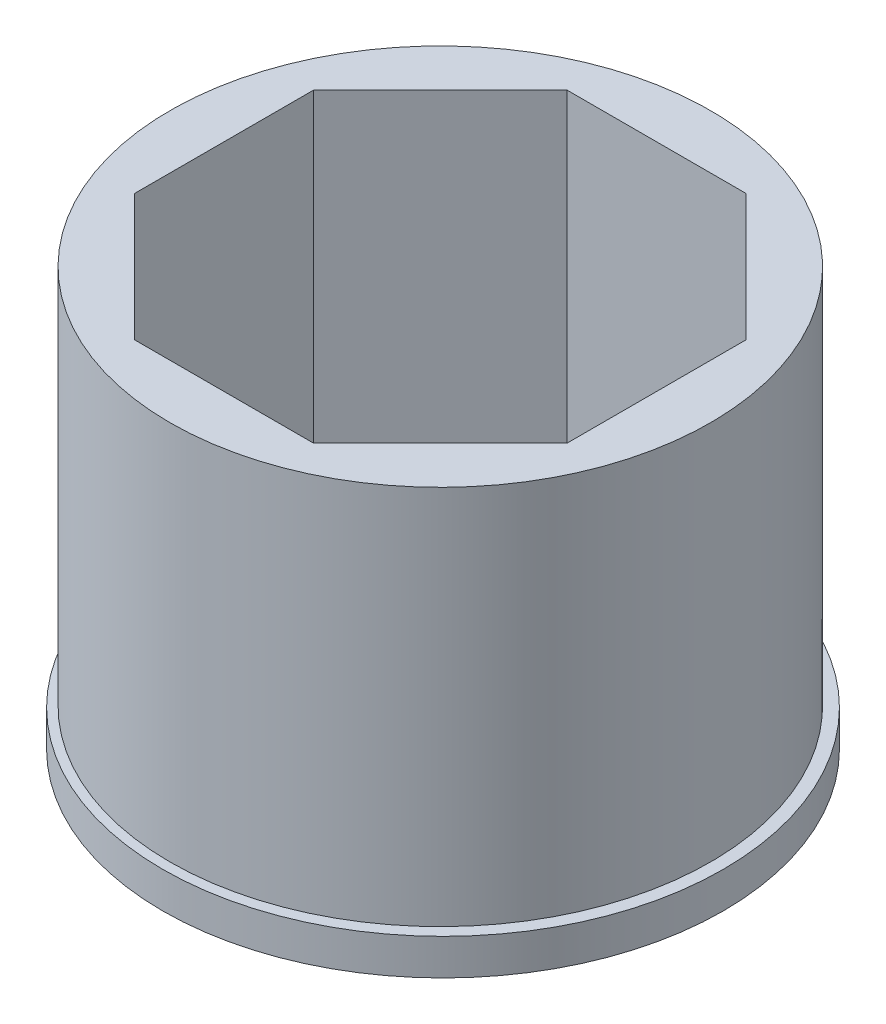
ISO-10303-21;
HEADER;
FILE_DESCRIPTION(('STEP AP214'),'2;1');
FILE_NAME('part.step','',(''),(''),'','','');
FILE_SCHEMA(('AUTOMOTIVE_DESIGN { 1 0 10303 214 1 1 1 1 }'));
ENDSEC;
DATA;
#1=APPLICATION_CONTEXT('core data for automotive mechanical design processes');
#2=APPLICATION_PROTOCOL_DEFINITION('international standard','automotive_design',2000,#1);
#3=PRODUCT_CONTEXT('',#1,'mechanical');
#4=PRODUCT('Part','Part','',(#3));
#5=PRODUCT_RELATED_PRODUCT_CATEGORY('part','',(#4));
#6=PRODUCT_DEFINITION_FORMATION('','',#4);
#7=PRODUCT_DEFINITION_CONTEXT('part definition',#1,'design');
#8=PRODUCT_DEFINITION('design','',#6,#7);
#9=PRODUCT_DEFINITION_SHAPE('','',#8);
#10=(LENGTH_UNIT() NAMED_UNIT(*) SI_UNIT(.MILLI.,.METRE.));
#11=(NAMED_UNIT(*) PLANE_ANGLE_UNIT() SI_UNIT($,.RADIAN.));
#12=(NAMED_UNIT(*) SI_UNIT($,.STERADIAN.) SOLID_ANGLE_UNIT());
#13=UNCERTAINTY_MEASURE_WITH_UNIT(LENGTH_MEASURE(1.E-05),#10,'distance_accuracy_value','');
#14=(GEOMETRIC_REPRESENTATION_CONTEXT(3) GLOBAL_UNCERTAINTY_ASSIGNED_CONTEXT((#13)) GLOBAL_UNIT_ASSIGNED_CONTEXT((#10,
#11,#12)) REPRESENTATION_CONTEXT('',''));
#15=CARTESIAN_POINT('',(0.,0.,0.));
#16=DIRECTION('',(0.,0.,1.));
#17=DIRECTION('',(1.,0.,0.));
#18=AXIS2_PLACEMENT_3D('',#15,#16,#17);
#19=CARTESIAN_POINT('',(0.,9.5,0.));
#20=DIRECTION('',(0.,1.,0.));
#21=DIRECTION('',(0.,0.,1.));
#22=AXIS2_PLACEMENT_3D('',#19,#20,#21);
#23=PLANE('',#22);
#24=CARTESIAN_POINT('',(0.,9.5,0.));
#25=DIRECTION('',(0.,1.,0.));
#26=DIRECTION('',(0.,0.,1.));
#27=AXIS2_PLACEMENT_3D('',#24,#25,#26);
#28=CIRCLE('',#27,6.75);
#29=CARTESIAN_POINT('',(0.,9.5,6.75));
#30=VERTEX_POINT('',#29);
#31=EDGE_CURVE('E144',#30,#30,#28,.T.);
#32=ORIENTED_EDGE('',*,*,#31,.T.);
#33=EDGE_LOOP('',(#32));
#34=FACE_BOUND('',#33,.T.);
#35=DIRECTION('',(-0.707106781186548,0.,0.707106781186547));
#36=VECTOR('',#35,1.);
#37=CARTESIAN_POINT('',(3.81837661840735,9.5,3.81837661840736));
#38=LINE('',#37,#36);
#39=CARTESIAN_POINT('',(5.4,9.5,2.23675323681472));
#40=VERTEX_POINT('',#39);
#41=CARTESIAN_POINT('',(2.23675323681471,9.5,5.4));
#42=VERTEX_POINT('',#41);
#43=EDGE_CURVE('E99',#40,#42,#38,.T.);
#44=ORIENTED_EDGE('',*,*,#43,.T.);
#45=DIRECTION('',(-1.,0.,0.));
#46=VECTOR('',#45,1.);
#47=CARTESIAN_POINT('',(0.,9.5,5.4));
#48=LINE('',#47,#46);
#49=CARTESIAN_POINT('',(-2.23675323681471,9.5,5.4));
#50=VERTEX_POINT('',#49);
#51=EDGE_CURVE('E133',#42,#50,#48,.T.);
#52=ORIENTED_EDGE('',*,*,#51,.T.);
#53=DIRECTION('',(-0.707106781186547,0.,-0.707106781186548));
#54=VECTOR('',#53,1.);
#55=CARTESIAN_POINT('',(-3.81837661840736,9.5,3.81837661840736));
#56=LINE('',#55,#54);
#57=CARTESIAN_POINT('',(-5.4,9.5,2.23675323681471));
#58=VERTEX_POINT('',#57);
#59=EDGE_CURVE('E135',#50,#58,#56,.T.);
#60=ORIENTED_EDGE('',*,*,#59,.T.);
#61=DIRECTION('',(0.,0.,-1.));
#62=VECTOR('',#61,1.);
#63=CARTESIAN_POINT('',(-5.4,9.5,0.));
#64=LINE('',#63,#62);
#65=CARTESIAN_POINT('',(-5.4,9.5,-2.23675323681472));
#66=VERTEX_POINT('',#65);
#67=EDGE_CURVE('E126',#58,#66,#64,.T.);
#68=ORIENTED_EDGE('',*,*,#67,.T.);
#69=DIRECTION('',(0.707106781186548,0.,-0.707106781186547));
#70=VECTOR('',#69,1.);
#71=CARTESIAN_POINT('',(-3.81837661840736,9.5,-3.81837661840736));
#72=LINE('',#71,#70);
#73=CARTESIAN_POINT('',(-2.23675323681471,9.5,-5.4));
#74=VERTEX_POINT('',#73);
#75=EDGE_CURVE('E127',#66,#74,#72,.T.);
#76=ORIENTED_EDGE('',*,*,#75,.T.);
#77=DIRECTION('',(1.,0.,0.));
#78=VECTOR('',#77,1.);
#79=CARTESIAN_POINT('',(0.,9.5,-5.4));
#80=LINE('',#79,#78);
#81=CARTESIAN_POINT('',(2.23675323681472,9.5,-5.4));
#82=VERTEX_POINT('',#81);
#83=EDGE_CURVE('E122',#74,#82,#80,.T.);
#84=ORIENTED_EDGE('',*,*,#83,.T.);
#85=DIRECTION('',(0.707106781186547,0.,0.707106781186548));
#86=VECTOR('',#85,1.);
#87=CARTESIAN_POINT('',(3.81837661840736,9.5,-3.81837661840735));
#88=LINE('',#87,#86);
#89=CARTESIAN_POINT('',(5.4,9.5,-2.23675323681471));
#90=VERTEX_POINT('',#89);
#91=EDGE_CURVE('E118',#82,#90,#88,.T.);
#92=ORIENTED_EDGE('',*,*,#91,.T.);
#93=DIRECTION('',(0.,0.,1.));
#94=VECTOR('',#93,1.);
#95=CARTESIAN_POINT('',(5.4,9.5,0.));
#96=LINE('',#95,#94);
#97=EDGE_CURVE('E102',#90,#40,#96,.T.);
#98=ORIENTED_EDGE('',*,*,#97,.T.);
#99=EDGE_LOOP('',(#44,#52,#60,#68,#76,#84,#92,#98));
#100=FACE_BOUND('',#99,.T.);
#101=ADVANCED_FACE('F39',(#34,#100),#23,.T.);
#102=CARTESIAN_POINT('',(0.0674329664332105,-0.9,0.));
#103=DIRECTION('',(0.,1.,0.));
#104=DIRECTION('',(0.,0.,1.));
#105=AXIS2_PLACEMENT_3D('',#102,#103,#104);
#106=PLANE('',#105);
#107=CARTESIAN_POINT('',(0.0674329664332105,-0.9,0.));
#108=DIRECTION('',(0.,1.,0.));
#109=DIRECTION('',(0.,0.,1.));
#110=AXIS2_PLACEMENT_3D('',#107,#108,#109);
#111=CIRCLE('',#110,7.);
#112=CARTESIAN_POINT('',(0.0674329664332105,-0.9,7.));
#113=VERTEX_POINT('',#112);
#114=EDGE_CURVE('E139',#113,#113,#111,.T.);
#115=ORIENTED_EDGE('',*,*,#114,.F.);
#116=EDGE_LOOP('',(#115));
#117=FACE_BOUND('',#116,.T.);
#118=DIRECTION('',(-1.,0.,0.));
#119=VECTOR('',#118,1.);
#120=CARTESIAN_POINT('',(0.0674329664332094,-0.9,5.4));
#121=LINE('',#120,#119);
#122=CARTESIAN_POINT('',(2.23675323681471,-0.9,5.4));
#123=VERTEX_POINT('',#122);
#124=CARTESIAN_POINT('',(-2.23675323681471,-0.9,5.4));
#125=VERTEX_POINT('',#124);
#126=EDGE_CURVE('E11',#123,#125,#121,.T.);
#127=ORIENTED_EDGE('',*,*,#126,.F.);
#128=DIRECTION('',(-0.707106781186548,0.,0.707106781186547));
#129=VECTOR('',#128,1.);
#130=CARTESIAN_POINT('',(3.85209310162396,-0.9,3.78466013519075));
#131=LINE('',#130,#129);
#132=CARTESIAN_POINT('',(5.4,-0.9,2.23675323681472));
#133=VERTEX_POINT('',#132);
#134=EDGE_CURVE('E150',#133,#123,#131,.T.);
#135=ORIENTED_EDGE('',*,*,#134,.F.);
#136=DIRECTION('',(0.,0.,1.));
#137=VECTOR('',#136,1.);
#138=CARTESIAN_POINT('',(5.4,-0.9,0.));
#139=LINE('',#138,#137);
#140=CARTESIAN_POINT('',(5.4,-0.9,-2.23675323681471));
#141=VERTEX_POINT('',#140);
#142=EDGE_CURVE('E113',#141,#133,#139,.T.);
#143=ORIENTED_EDGE('',*,*,#142,.F.);
#144=DIRECTION('',(0.707106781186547,0.,0.707106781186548));
#145=VECTOR('',#144,1.);
#146=CARTESIAN_POINT('',(3.85209310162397,-0.9,-3.78466013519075));
#147=LINE('',#146,#145);
#148=CARTESIAN_POINT('',(2.23675323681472,-0.9,-5.4));
#149=VERTEX_POINT('',#148);
#150=EDGE_CURVE('E155',#149,#141,#147,.T.);
#151=ORIENTED_EDGE('',*,*,#150,.F.);
#152=DIRECTION('',(1.,0.,0.));
#153=VECTOR('',#152,1.);
#154=CARTESIAN_POINT('',(0.0674329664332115,-0.9,-5.4));
#155=LINE('',#154,#153);
#156=CARTESIAN_POINT('',(-2.23675323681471,-0.9,-5.4));
#157=VERTEX_POINT('',#156);
#158=EDGE_CURVE('E151',#157,#149,#155,.T.);
#159=ORIENTED_EDGE('',*,*,#158,.F.);
#160=DIRECTION('',(0.707106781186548,0.,-0.707106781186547));
#161=VECTOR('',#160,1.);
#162=CARTESIAN_POINT('',(-3.78466013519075,-0.9,-3.85209310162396));
#163=LINE('',#162,#161);
#164=CARTESIAN_POINT('',(-5.4,-0.9,-2.23675323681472));
#165=VERTEX_POINT('',#164);
#166=EDGE_CURVE('E157',#165,#157,#163,.T.);
#167=ORIENTED_EDGE('',*,*,#166,.F.);
#168=DIRECTION('',(0.,0.,-1.));
#169=VECTOR('',#168,1.);
#170=CARTESIAN_POINT('',(-5.4,-0.9,0.));
#171=LINE('',#170,#169);
#172=CARTESIAN_POINT('',(-5.4,-0.9,2.23675323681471));
#173=VERTEX_POINT('',#172);
#174=EDGE_CURVE('E159',#173,#165,#171,.T.);
#175=ORIENTED_EDGE('',*,*,#174,.F.);
#176=DIRECTION('',(-0.707106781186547,0.,-0.707106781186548));
#177=VECTOR('',#176,1.);
#178=CARTESIAN_POINT('',(-3.78466013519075,-0.9,3.85209310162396));
#179=LINE('',#178,#177);
#180=EDGE_CURVE('E50',#125,#173,#179,.T.);
#181=ORIENTED_EDGE('',*,*,#180,.F.);
#182=EDGE_LOOP('',(#127,#135,#143,#151,#159,#167,#175,#181));
#183=FACE_BOUND('',#182,.T.);
#184=ADVANCED_FACE('F180',(#117,#183),#106,.F.);
#185=CARTESIAN_POINT('',(0.,9.5,0.));
#186=DIRECTION('',(0.,-1.,0.));
#187=DIRECTION('',(0.,0.,-1.));
#188=AXIS2_PLACEMENT_3D('',#185,#186,#187);
#189=CYLINDRICAL_SURFACE('',#188,6.75);
#190=ORIENTED_EDGE('',*,*,#31,.F.);
#191=EDGE_LOOP('',(#190));
#192=FACE_BOUND('',#191,.T.);
#193=CARTESIAN_POINT('',(0.,0.,0.));
#194=DIRECTION('',(0.,1.,0.));
#195=DIRECTION('',(0.,0.,1.));
#196=AXIS2_PLACEMENT_3D('',#193,#194,#195);
#197=CIRCLE('',#196,6.75);
#198=CARTESIAN_POINT('',(0.,0.,6.75));
#199=VERTEX_POINT('',#198);
#200=EDGE_CURVE('E142',#199,#199,#197,.T.);
#201=ORIENTED_EDGE('',*,*,#200,.T.);
#202=EDGE_LOOP('',(#201));
#203=FACE_BOUND('',#202,.T.);
#204=ADVANCED_FACE('F41',(#192,#203),#189,.T.);
#205=CARTESIAN_POINT('',(0.0674329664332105,-0.9,0.));
#206=DIRECTION('',(0.,1.,0.));
#207=DIRECTION('',(0.,0.,1.));
#208=AXIS2_PLACEMENT_3D('',#205,#206,#207);
#209=CYLINDRICAL_SURFACE('',#208,7.);
#210=ORIENTED_EDGE('',*,*,#114,.T.);
#211=EDGE_LOOP('',(#210));
#212=FACE_BOUND('',#211,.T.);
#213=CARTESIAN_POINT('',(0.0674329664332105,0.,0.));
#214=DIRECTION('',(0.,1.,0.));
#215=DIRECTION('',(0.,0.,1.));
#216=AXIS2_PLACEMENT_3D('',#213,#214,#215);
#217=CIRCLE('',#216,7.);
#218=CARTESIAN_POINT('',(0.0674329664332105,0.,7.));
#219=VERTEX_POINT('',#218);
#220=EDGE_CURVE('E140',#219,#219,#217,.T.);
#221=ORIENTED_EDGE('',*,*,#220,.F.);
#222=EDGE_LOOP('',(#221));
#223=FACE_BOUND('',#222,.T.);
#224=ADVANCED_FACE('F217',(#212,#223),#209,.T.);
#225=CARTESIAN_POINT('',(0.0674329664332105,0.,0.));
#226=DIRECTION('',(0.,1.,0.));
#227=DIRECTION('',(0.,0.,1.));
#228=AXIS2_PLACEMENT_3D('',#225,#226,#227);
#229=PLANE('',#228);
#230=ORIENTED_EDGE('',*,*,#200,.F.);
#231=EDGE_LOOP('',(#230));
#232=FACE_BOUND('',#231,.T.);
#233=ORIENTED_EDGE('',*,*,#220,.T.);
#234=EDGE_LOOP('',(#233));
#235=FACE_BOUND('',#234,.T.);
#236=ADVANCED_FACE('F216',(#232,#235),#229,.T.);
#237=CARTESIAN_POINT('',(2.23675323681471,-15.,5.4));
#238=DIRECTION('',(0.,0.,-1.));
#239=DIRECTION('',(-1.,0.,0.));
#240=AXIS2_PLACEMENT_3D('',#237,#238,#239);
#241=PLANE('',#240);
#242=DIRECTION('',(0.,1.,0.));
#243=VECTOR('',#242,1.);
#244=CARTESIAN_POINT('',(2.23675323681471,-15.,5.4));
#245=LINE('',#244,#243);
#246=EDGE_CURVE('E53',#123,#42,#245,.T.);
#247=ORIENTED_EDGE('',*,*,#246,.F.);
#248=ORIENTED_EDGE('',*,*,#126,.T.);
#249=DIRECTION('',(0.,1.,0.));
#250=VECTOR('',#249,1.);
#251=CARTESIAN_POINT('',(-2.23675323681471,-15.,5.4));
#252=LINE('',#251,#250);
#253=EDGE_CURVE('E106',#125,#50,#252,.T.);
#254=ORIENTED_EDGE('',*,*,#253,.T.);
#255=ORIENTED_EDGE('',*,*,#51,.F.);
#256=EDGE_LOOP('',(#247,#248,#254,#255));
#257=FACE_BOUND('',#256,.T.);
#258=ADVANCED_FACE('F193',(#257),#241,.T.);
#259=CARTESIAN_POINT('',(-2.23675323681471,-15.,5.4));
#260=DIRECTION('',(0.707106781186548,0.,-0.707106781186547));
#261=DIRECTION('',(-0.707106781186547,0.,-0.707106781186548));
#262=AXIS2_PLACEMENT_3D('',#259,#260,#261);
#263=PLANE('',#262);
#264=ORIENTED_EDGE('',*,*,#253,.F.);
#265=ORIENTED_EDGE('',*,*,#180,.T.);
#266=DIRECTION('',(0.,1.,0.));
#267=VECTOR('',#266,1.);
#268=CARTESIAN_POINT('',(-5.4,-15.,2.23675323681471));
#269=LINE('',#268,#267);
#270=EDGE_CURVE('E164',#173,#58,#269,.T.);
#271=ORIENTED_EDGE('',*,*,#270,.T.);
#272=ORIENTED_EDGE('',*,*,#59,.F.);
#273=EDGE_LOOP('',(#264,#265,#271,#272));
#274=FACE_BOUND('',#273,.T.);
#275=ADVANCED_FACE('F165',(#274),#263,.T.);
#276=CARTESIAN_POINT('',(-5.4,-15.,2.23675323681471));
#277=DIRECTION('',(1.,0.,0.));
#278=DIRECTION('',(0.,0.,-1.));
#279=AXIS2_PLACEMENT_3D('',#276,#277,#278);
#280=PLANE('',#279);
#281=ORIENTED_EDGE('',*,*,#270,.F.);
#282=ORIENTED_EDGE('',*,*,#174,.T.);
#283=DIRECTION('',(0.,1.,0.));
#284=VECTOR('',#283,1.);
#285=CARTESIAN_POINT('',(-5.4,-15.,-2.23675323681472));
#286=LINE('',#285,#284);
#287=EDGE_CURVE('E172',#165,#66,#286,.T.);
#288=ORIENTED_EDGE('',*,*,#287,.T.);
#289=ORIENTED_EDGE('',*,*,#67,.F.);
#290=EDGE_LOOP('',(#281,#282,#288,#289));
#291=FACE_BOUND('',#290,.T.);
#292=ADVANCED_FACE('F171',(#291),#280,.T.);
#293=CARTESIAN_POINT('',(-5.4,-15.,-2.23675323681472));
#294=DIRECTION('',(0.707106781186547,0.,0.707106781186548));
#295=DIRECTION('',(0.707106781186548,0.,-0.707106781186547));
#296=AXIS2_PLACEMENT_3D('',#293,#294,#295);
#297=PLANE('',#296);
#298=ORIENTED_EDGE('',*,*,#287,.F.);
#299=ORIENTED_EDGE('',*,*,#166,.T.);
#300=DIRECTION('',(0.,1.,0.));
#301=VECTOR('',#300,1.);
#302=CARTESIAN_POINT('',(-2.23675323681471,-15.,-5.4));
#303=LINE('',#302,#301);
#304=EDGE_CURVE('E183',#157,#74,#303,.T.);
#305=ORIENTED_EDGE('',*,*,#304,.T.);
#306=ORIENTED_EDGE('',*,*,#75,.F.);
#307=EDGE_LOOP('',(#298,#299,#305,#306));
#308=FACE_BOUND('',#307,.T.);
#309=ADVANCED_FACE('F182',(#308),#297,.T.);
#310=CARTESIAN_POINT('',(-2.23675323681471,-15.,-5.4));
#311=DIRECTION('',(0.,0.,1.));
#312=DIRECTION('',(1.,0.,0.));
#313=AXIS2_PLACEMENT_3D('',#310,#311,#312);
#314=PLANE('',#313);
#315=ORIENTED_EDGE('',*,*,#304,.F.);
#316=ORIENTED_EDGE('',*,*,#158,.T.);
#317=DIRECTION('',(0.,1.,0.));
#318=VECTOR('',#317,1.);
#319=CARTESIAN_POINT('',(2.23675323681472,-15.,-5.4));
#320=LINE('',#319,#318);
#321=EDGE_CURVE('E186',#149,#82,#320,.T.);
#322=ORIENTED_EDGE('',*,*,#321,.T.);
#323=ORIENTED_EDGE('',*,*,#83,.F.);
#324=EDGE_LOOP('',(#315,#316,#322,#323));
#325=FACE_BOUND('',#324,.T.);
#326=ADVANCED_FACE('F187',(#325),#314,.T.);
#327=CARTESIAN_POINT('',(2.23675323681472,-15.,-5.4));
#328=DIRECTION('',(-0.707106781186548,0.,0.707106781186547));
#329=DIRECTION('',(0.707106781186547,0.,0.707106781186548));
#330=AXIS2_PLACEMENT_3D('',#327,#328,#329);
#331=PLANE('',#330);
#332=ORIENTED_EDGE('',*,*,#321,.F.);
#333=ORIENTED_EDGE('',*,*,#150,.T.);
#334=DIRECTION('',(0.,1.,0.));
#335=VECTOR('',#334,1.);
#336=CARTESIAN_POINT('',(5.4,-15.,-2.23675323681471));
#337=LINE('',#336,#335);
#338=EDGE_CURVE('E114',#141,#90,#337,.T.);
#339=ORIENTED_EDGE('',*,*,#338,.T.);
#340=ORIENTED_EDGE('',*,*,#91,.F.);
#341=EDGE_LOOP('',(#332,#333,#339,#340));
#342=FACE_BOUND('',#341,.T.);
#343=ADVANCED_FACE('F200',(#342),#331,.T.);
#344=CARTESIAN_POINT('',(5.4,-15.,-2.23675323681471));
#345=DIRECTION('',(-1.,0.,0.));
#346=DIRECTION('',(0.,0.,1.));
#347=AXIS2_PLACEMENT_3D('',#344,#345,#346);
#348=PLANE('',#347);
#349=ORIENTED_EDGE('',*,*,#338,.F.);
#350=ORIENTED_EDGE('',*,*,#142,.T.);
#351=DIRECTION('',(0.,1.,0.));
#352=VECTOR('',#351,1.);
#353=CARTESIAN_POINT('',(5.4,-15.,2.23675323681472));
#354=LINE('',#353,#352);
#355=EDGE_CURVE('E56',#133,#40,#354,.T.);
#356=ORIENTED_EDGE('',*,*,#355,.T.);
#357=ORIENTED_EDGE('',*,*,#97,.F.);
#358=EDGE_LOOP('',(#349,#350,#356,#357));
#359=FACE_BOUND('',#358,.T.);
#360=ADVANCED_FACE('F109',(#359),#348,.T.);
#361=CARTESIAN_POINT('',(5.4,-15.,2.23675323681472));
#362=DIRECTION('',(-0.707106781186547,0.,-0.707106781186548));
#363=DIRECTION('',(-0.707106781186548,0.,0.707106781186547));
#364=AXIS2_PLACEMENT_3D('',#361,#362,#363);
#365=PLANE('',#364);
#366=ORIENTED_EDGE('',*,*,#355,.F.);
#367=ORIENTED_EDGE('',*,*,#134,.T.);
#368=ORIENTED_EDGE('',*,*,#246,.T.);
#369=ORIENTED_EDGE('',*,*,#43,.F.);
#370=EDGE_LOOP('',(#366,#367,#368,#369));
#371=FACE_BOUND('',#370,.T.);
#372=ADVANCED_FACE('F103',(#371),#365,.T.);
#373=CLOSED_SHELL('',(#101,#184,#204,#224,#236,#258,#275,#292,#309,#326,#343,#360,#372));
#374=MANIFOLD_SOLID_BREP('B2',#373);
#375=ADVANCED_BREP_SHAPE_REPRESENTATION('',(#18,#374),#14);
#376=SHAPE_DEFINITION_REPRESENTATION(#9,#375);
ENDSEC;
END-ISO-10303-21;
